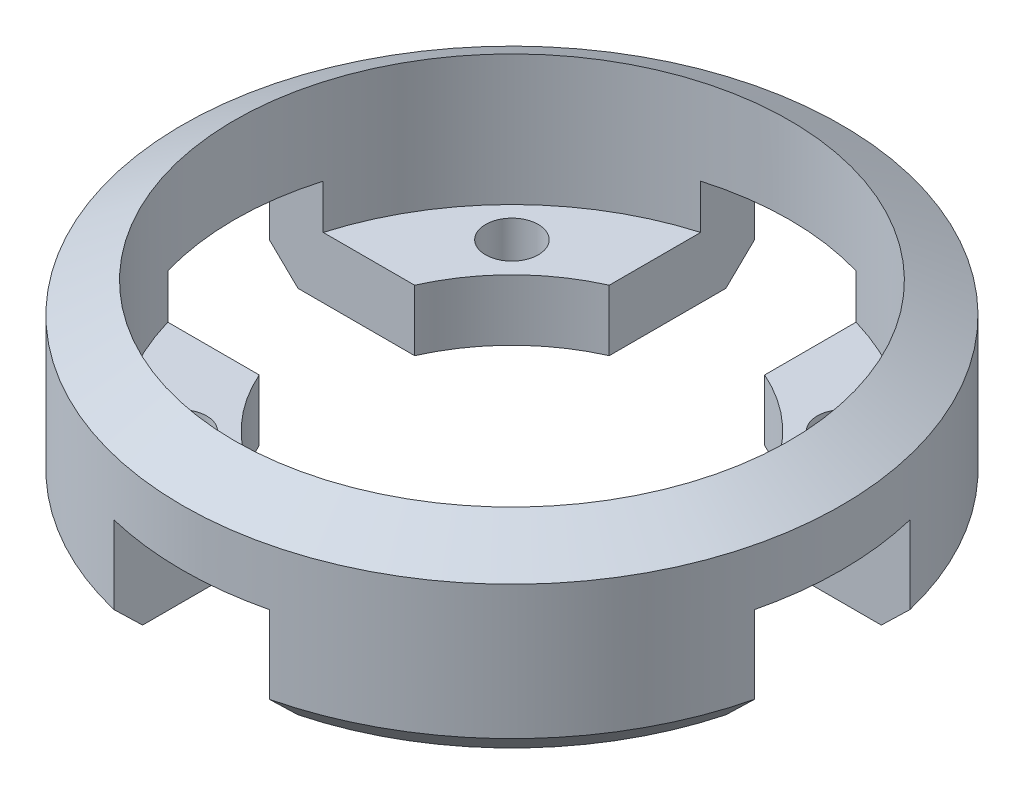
from build123d import *

# Parameters (mm, degrees)
SKETCH2_R          = 35.052
CUT_EXTRUDE1_DEPTH = 93.232607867
CUT_EXTRUDE3_DEPTH = 19.304
SKETCH5_R          = 4.826
CUT_EXTRUDE4_DEPTH = 93.232607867


with BuildPart() as part:
    # Sketch1 → Revolve1 (revolve)
    with BuildSketch(Plane.XY, mode=Mode.PRIVATE) as revolve1_sk:
        Polygon((0, 0), (-55.245, 0), (-60.325, 5.08), (-60.325, 29.552738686), (-50.8, 35.052), (-50.8, 11.176), (0, 11.176), align=None)
    revolve(revolve1_sk.sketch.rotate(Axis((0, 11.176, 0), (0, -1, 0)), 270), axis=Axis((0, 11.176, 0), (0, -1, 0)))

    # Sketch2 → Cut-Extrude1 (cut, through all)
    with BuildSketch(Plane.XZ):
        with Locations(Location((0, 0, 0), (0, 0, 270))):
            Circle(SKETCH2_R)
    extrude(amount=-CUT_EXTRUDE1_DEPTH, mode=Mode.SUBTRACT)

    # Sketch4 → Cut-Extrude3 (cut)
    with BuildSketch(Plane.XZ):
        Polygon((-60.325, 14.224), (-60.325, -14.224), (-14.224, -14.224), (-14.224, -60.325), (14.224, -60.325), (14.224, -14.224), (60.325, -14.224), (60.325, 14.224), (14.224, 14.224), (14.224, 60.325), (-14.224, 60.325), (-14.224, 14.224), align=None)
    extrude(amount=-CUT_EXTRUDE3_DEPTH, mode=Mode.SUBTRACT)

    # Sketch5 → Cut-Extrude4 (cut, through all)
    with BuildSketch(Plane(origin=(0, 0, 0), x_dir=(1, 0, 0), z_dir=(0, 1, 0))):
        with Locations(Location((30.353265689, -30.353265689, 0), (0, 0, 270))):
            Circle(SKETCH5_R)
        with Locations(Location((-30.353265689, -30.353265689, 0), (0, 0, 270))):
            Circle(SKETCH5_R)
        with Locations(Location((-30.353265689, 30.353265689, 0), (0, 0, 270))):
            Circle(SKETCH5_R)
        with Locations(Location((30.353265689, 30.353265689, 0), (0, 0, 270))):
            Circle(SKETCH5_R)
    extrude(amount=CUT_EXTRUDE4_DEPTH, mode=Mode.SUBTRACT)


solid = part.part
